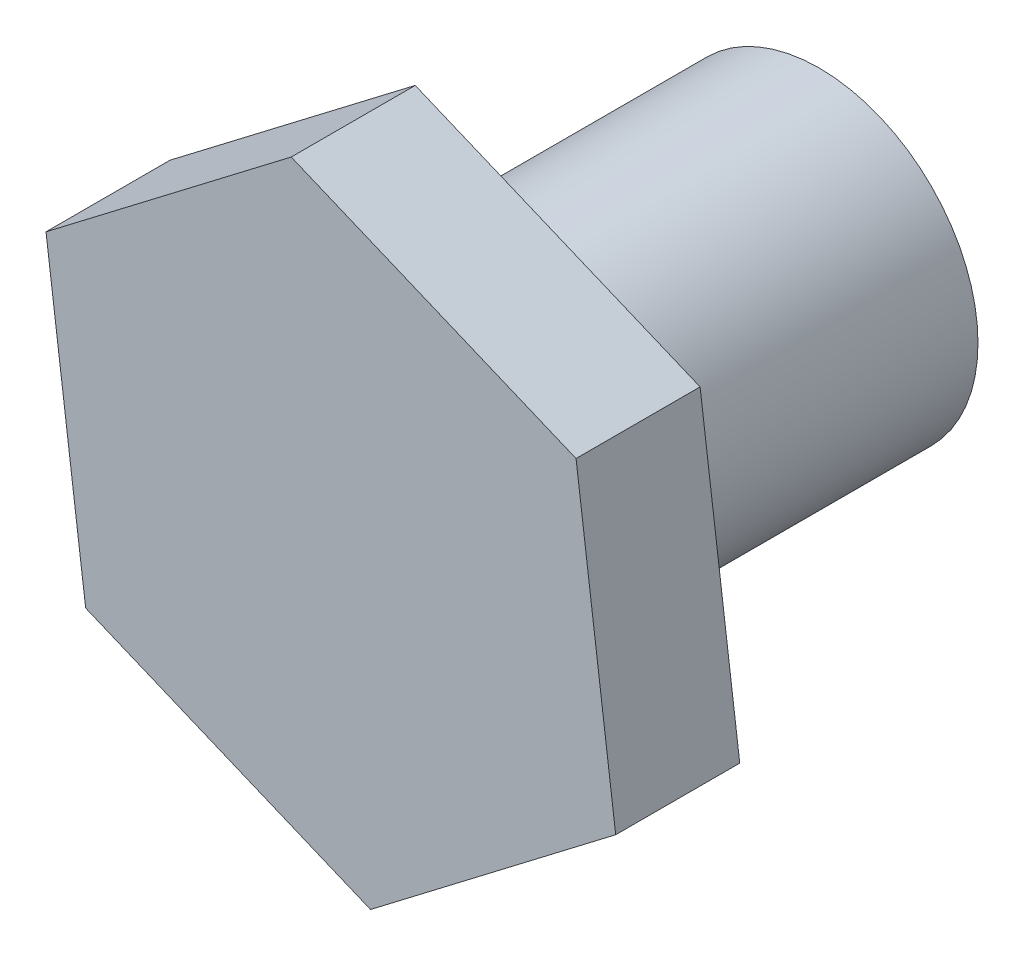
from build123d import *

# Parameters (mm, degrees)
SKETCH1_R      = 5.199803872
EXTRUDE1_DEPTH = 11.938
EXTRUDE2_DEPTH = 4.064


with BuildPart() as part:
    # Sketch1 → Extrude1 (new body)
    with BuildSketch(Plane.XY):
        with Locations((-24.011734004, 40.793838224)):
            Circle(SKETCH1_R)
    extrude(amount=-EXTRUDE1_DEPTH)

    # Sketch2 → Extrude2 (add)
    with BuildSketch(Plane.XY):
        Polygon((-22.712577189, 30.768016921), (-14.679539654, 36.906030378), (-15.978696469, 46.931851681), (-25.310890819, 50.819659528), (-33.343928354, 44.68164607), (-32.044771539, 34.655824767), align=None)
    extrude(amount=EXTRUDE2_DEPTH)


solid = part.part
